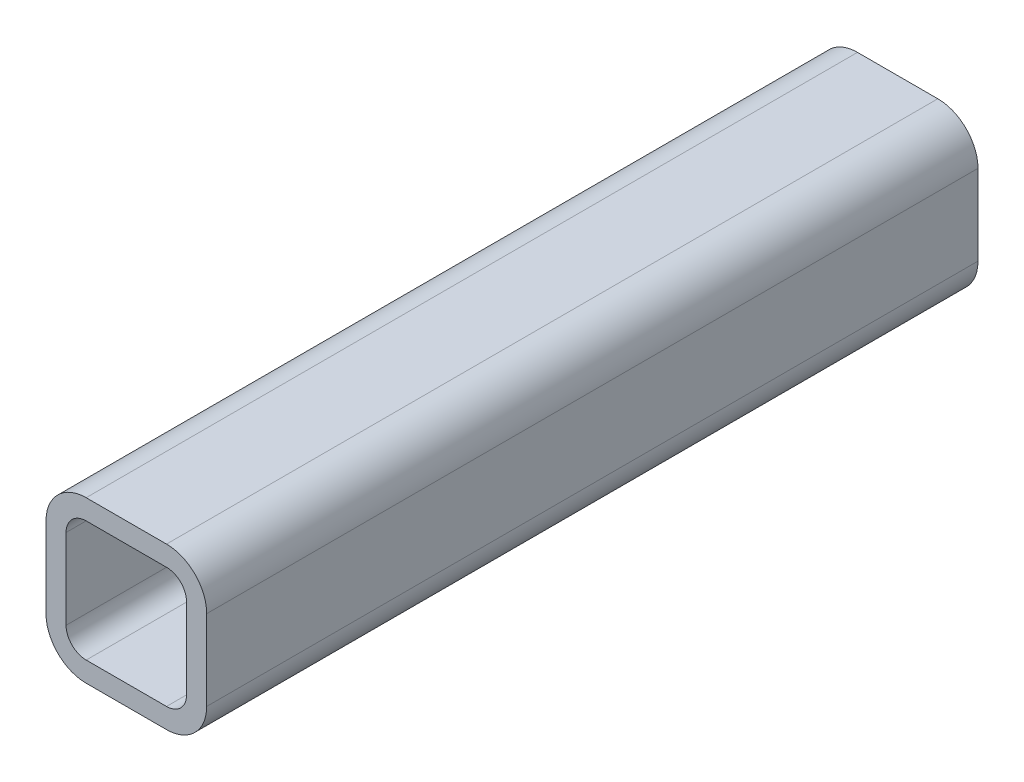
ISO-10303-21;
HEADER;
FILE_DESCRIPTION(('STEP AP214'),'2;1');
FILE_NAME('part.step','',(''),(''),'','','');
FILE_SCHEMA(('AUTOMOTIVE_DESIGN { 1 0 10303 214 1 1 1 1 }'));
ENDSEC;
DATA;
#1=APPLICATION_CONTEXT('core data for automotive mechanical design processes');
#2=APPLICATION_PROTOCOL_DEFINITION('international standard','automotive_design',2000,#1);
#3=PRODUCT_CONTEXT('',#1,'mechanical');
#4=PRODUCT('Part','Part','',(#3));
#5=PRODUCT_RELATED_PRODUCT_CATEGORY('part','',(#4));
#6=PRODUCT_DEFINITION_FORMATION('','',#4);
#7=PRODUCT_DEFINITION_CONTEXT('part definition',#1,'design');
#8=PRODUCT_DEFINITION('design','',#6,#7);
#9=PRODUCT_DEFINITION_SHAPE('','',#8);
#10=(LENGTH_UNIT() NAMED_UNIT(*) SI_UNIT(.MILLI.,.METRE.));
#11=(NAMED_UNIT(*) PLANE_ANGLE_UNIT() SI_UNIT($,.RADIAN.));
#12=(NAMED_UNIT(*) SI_UNIT($,.STERADIAN.) SOLID_ANGLE_UNIT());
#13=UNCERTAINTY_MEASURE_WITH_UNIT(LENGTH_MEASURE(1.E-05),#10,'distance_accuracy_value','');
#14=(GEOMETRIC_REPRESENTATION_CONTEXT(3) GLOBAL_UNCERTAINTY_ASSIGNED_CONTEXT((#13)) GLOBAL_UNIT_ASSIGNED_CONTEXT((#10,
#11,#12)) REPRESENTATION_CONTEXT('',''));
#15=CARTESIAN_POINT('',(0.,0.,0.));
#16=DIRECTION('',(0.,0.,1.));
#17=DIRECTION('',(1.,0.,0.));
#18=AXIS2_PLACEMENT_3D('',#15,#16,#17);
#19=CARTESIAN_POINT('',(18.7710851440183,48.449418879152,304.8));
#20=DIRECTION('',(0.,0.,1.));
#21=DIRECTION('',(1.,0.,0.));
#22=AXIS2_PLACEMENT_3D('',#19,#20,#21);
#23=PLANE('',#22);
#24=CARTESIAN_POINT('',(18.7710851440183,48.449418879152,304.8));
#25=DIRECTION('',(0.,0.,1.));
#26=DIRECTION('',(1.,0.,0.));
#27=AXIS2_PLACEMENT_3D('',#24,#25,#26);
#28=CIRCLE('',#27,15.875);
#29=CARTESIAN_POINT('',(18.7710851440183,64.324418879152,304.8));
#30=VERTEX_POINT('',#29);
#31=CARTESIAN_POINT('',(2.89608514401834,48.449418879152,304.8));
#32=VERTEX_POINT('',#31);
#33=EDGE_CURVE('E211',#30,#32,#28,.T.);
#34=ORIENTED_EDGE('',*,*,#33,.T.);
#35=DIRECTION('',(0.,-1.,0.));
#36=VECTOR('',#35,1.);
#37=CARTESIAN_POINT('',(2.89608514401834,16.699418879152,304.8));
#38=LINE('',#37,#36);
#39=CARTESIAN_POINT('',(2.89608514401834,16.699418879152,304.8));
#40=VERTEX_POINT('',#39);
#41=EDGE_CURVE('E214',#32,#40,#38,.T.);
#42=ORIENTED_EDGE('',*,*,#41,.T.);
#43=CARTESIAN_POINT('',(18.7710851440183,16.699418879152,304.8));
#44=DIRECTION('',(0.,0.,1.));
#45=DIRECTION('',(1.,0.,0.));
#46=AXIS2_PLACEMENT_3D('',#43,#44,#45);
#47=CIRCLE('',#46,15.875);
#48=CARTESIAN_POINT('',(18.7710851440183,0.824418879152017,304.8));
#49=VERTEX_POINT('',#48);
#50=EDGE_CURVE('E217',#40,#49,#47,.T.);
#51=ORIENTED_EDGE('',*,*,#50,.T.);
#52=DIRECTION('',(1.,0.,0.));
#53=VECTOR('',#52,1.);
#54=CARTESIAN_POINT('',(50.5210851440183,0.824418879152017,304.8));
#55=LINE('',#54,#53);
#56=CARTESIAN_POINT('',(50.5210851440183,0.824418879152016,304.8));
#57=VERTEX_POINT('',#56);
#58=EDGE_CURVE('E219',#49,#57,#55,.T.);
#59=ORIENTED_EDGE('',*,*,#58,.T.);
#60=CARTESIAN_POINT('',(50.5210851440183,16.699418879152,304.8));
#61=DIRECTION('',(0.,0.,1.));
#62=DIRECTION('',(1.,0.,0.));
#63=AXIS2_PLACEMENT_3D('',#60,#61,#62);
#64=CIRCLE('',#63,15.875);
#65=CARTESIAN_POINT('',(66.3960851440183,16.699418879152,304.8));
#66=VERTEX_POINT('',#65);
#67=EDGE_CURVE('E221',#57,#66,#64,.T.);
#68=ORIENTED_EDGE('',*,*,#67,.T.);
#69=DIRECTION('',(0.,1.,0.));
#70=VECTOR('',#69,1.);
#71=CARTESIAN_POINT('',(66.3960851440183,48.449418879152,304.8));
#72=LINE('',#71,#70);
#73=CARTESIAN_POINT('',(66.3960851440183,48.449418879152,304.8));
#74=VERTEX_POINT('',#73);
#75=EDGE_CURVE('E223',#66,#74,#72,.T.);
#76=ORIENTED_EDGE('',*,*,#75,.T.);
#77=CARTESIAN_POINT('',(50.5210851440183,48.449418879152,304.8));
#78=DIRECTION('',(0.,0.,1.));
#79=DIRECTION('',(1.,0.,0.));
#80=AXIS2_PLACEMENT_3D('',#77,#78,#79);
#81=CIRCLE('',#80,15.875);
#82=CARTESIAN_POINT('',(50.5210851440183,64.324418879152,304.8));
#83=VERTEX_POINT('',#82);
#84=EDGE_CURVE('E225',#74,#83,#81,.T.);
#85=ORIENTED_EDGE('',*,*,#84,.T.);
#86=DIRECTION('',(-1.,0.,0.));
#87=VECTOR('',#86,1.);
#88=CARTESIAN_POINT('',(18.7710851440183,64.324418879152,304.8));
#89=LINE('',#88,#87);
#90=EDGE_CURVE('E227',#83,#30,#89,.T.);
#91=ORIENTED_EDGE('',*,*,#90,.T.);
#92=EDGE_LOOP('',(#34,#42,#51,#59,#68,#76,#85,#91));
#93=FACE_BOUND('',#92,.T.);
#94=DIRECTION('',(0.,-1.,0.));
#95=VECTOR('',#94,1.);
#96=CARTESIAN_POINT('',(10.8335851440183,16.699418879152,304.8));
#97=LINE('',#96,#95);
#98=CARTESIAN_POINT('',(10.8335851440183,48.449418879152,304.8));
#99=VERTEX_POINT('',#98);
#100=CARTESIAN_POINT('',(10.8335851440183,16.699418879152,304.8));
#101=VERTEX_POINT('',#100);
#102=EDGE_CURVE('E154',#99,#101,#97,.T.);
#103=ORIENTED_EDGE('',*,*,#102,.F.);
#104=CARTESIAN_POINT('',(18.7710851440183,48.449418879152,304.8));
#105=DIRECTION('',(0.,0.,1.));
#106=DIRECTION('',(1.,0.,0.));
#107=AXIS2_PLACEMENT_3D('',#104,#105,#106);
#108=CIRCLE('',#107,7.9375);
#109=CARTESIAN_POINT('',(18.7710851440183,56.386918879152,304.8));
#110=VERTEX_POINT('',#109);
#111=EDGE_CURVE('E146',#110,#99,#108,.T.);
#112=ORIENTED_EDGE('',*,*,#111,.F.);
#113=DIRECTION('',(-1.,0.,0.));
#114=VECTOR('',#113,1.);
#115=CARTESIAN_POINT('',(18.7710851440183,56.386918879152,304.8));
#116=LINE('',#115,#114);
#117=CARTESIAN_POINT('',(50.5210851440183,56.386918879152,304.8));
#118=VERTEX_POINT('',#117);
#119=EDGE_CURVE('E179',#118,#110,#116,.T.);
#120=ORIENTED_EDGE('',*,*,#119,.F.);
#121=CARTESIAN_POINT('',(50.5210851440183,48.449418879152,304.8));
#122=DIRECTION('',(0.,0.,1.));
#123=DIRECTION('',(1.,0.,0.));
#124=AXIS2_PLACEMENT_3D('',#121,#122,#123);
#125=CIRCLE('',#124,7.93750000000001);
#126=CARTESIAN_POINT('',(58.4585851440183,48.449418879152,304.8));
#127=VERTEX_POINT('',#126);
#128=EDGE_CURVE('E177',#127,#118,#125,.T.);
#129=ORIENTED_EDGE('',*,*,#128,.F.);
#130=DIRECTION('',(0.,1.,0.));
#131=VECTOR('',#130,1.);
#132=CARTESIAN_POINT('',(58.4585851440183,48.449418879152,304.8));
#133=LINE('',#132,#131);
#134=CARTESIAN_POINT('',(58.4585851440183,16.699418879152,304.8));
#135=VERTEX_POINT('',#134);
#136=EDGE_CURVE('E175',#135,#127,#133,.T.);
#137=ORIENTED_EDGE('',*,*,#136,.F.);
#138=CARTESIAN_POINT('',(50.5210851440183,16.699418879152,304.8));
#139=DIRECTION('',(0.,0.,1.));
#140=DIRECTION('',(1.,0.,0.));
#141=AXIS2_PLACEMENT_3D('',#138,#139,#140);
#142=CIRCLE('',#141,7.93750000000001);
#143=CARTESIAN_POINT('',(50.5210851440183,8.76191887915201,304.8));
#144=VERTEX_POINT('',#143);
#145=EDGE_CURVE('E173',#144,#135,#142,.T.);
#146=ORIENTED_EDGE('',*,*,#145,.F.);
#147=DIRECTION('',(1.,0.,0.));
#148=VECTOR('',#147,1.);
#149=CARTESIAN_POINT('',(50.5210851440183,8.76191887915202,304.8));
#150=LINE('',#149,#148);
#151=CARTESIAN_POINT('',(18.7710851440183,8.76191887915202,304.8));
#152=VERTEX_POINT('',#151);
#153=EDGE_CURVE('E169',#152,#144,#150,.T.);
#154=ORIENTED_EDGE('',*,*,#153,.F.);
#155=CARTESIAN_POINT('',(18.7710851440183,16.699418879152,304.8));
#156=DIRECTION('',(0.,0.,1.));
#157=DIRECTION('',(1.,0.,0.));
#158=AXIS2_PLACEMENT_3D('',#155,#156,#157);
#159=CIRCLE('',#158,7.9375);
#160=EDGE_CURVE('E167',#101,#152,#159,.T.);
#161=ORIENTED_EDGE('',*,*,#160,.F.);
#162=EDGE_LOOP('',(#103,#112,#120,#129,#137,#146,#154,#161));
#163=FACE_BOUND('',#162,.T.);
#164=ADVANCED_FACE('F33',(#93,#163),#23,.T.);
#165=CARTESIAN_POINT('',(18.7710851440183,48.449418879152,0.));
#166=DIRECTION('',(0.,0.,1.));
#167=DIRECTION('',(1.,0.,0.));
#168=AXIS2_PLACEMENT_3D('',#165,#166,#167);
#169=PLANE('',#168);
#170=CARTESIAN_POINT('',(18.7710851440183,48.449418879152,0.));
#171=DIRECTION('',(0.,0.,1.));
#172=DIRECTION('',(1.,0.,0.));
#173=AXIS2_PLACEMENT_3D('',#170,#171,#172);
#174=CIRCLE('',#173,15.875);
#175=CARTESIAN_POINT('',(18.7710851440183,64.324418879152,0.));
#176=VERTEX_POINT('',#175);
#177=CARTESIAN_POINT('',(2.89608514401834,48.449418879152,0.));
#178=VERTEX_POINT('',#177);
#179=EDGE_CURVE('E162',#176,#178,#174,.T.);
#180=ORIENTED_EDGE('',*,*,#179,.F.);
#181=DIRECTION('',(-1.,0.,0.));
#182=VECTOR('',#181,1.);
#183=CARTESIAN_POINT('',(18.7710851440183,64.324418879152,0.));
#184=LINE('',#183,#182);
#185=CARTESIAN_POINT('',(50.5210851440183,64.324418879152,0.));
#186=VERTEX_POINT('',#185);
#187=EDGE_CURVE('E215',#186,#176,#184,.T.);
#188=ORIENTED_EDGE('',*,*,#187,.F.);
#189=CARTESIAN_POINT('',(50.5210851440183,48.449418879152,0.));
#190=DIRECTION('',(0.,0.,1.));
#191=DIRECTION('',(1.,0.,0.));
#192=AXIS2_PLACEMENT_3D('',#189,#190,#191);
#193=CIRCLE('',#192,15.875);
#194=CARTESIAN_POINT('',(66.3960851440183,48.449418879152,0.));
#195=VERTEX_POINT('',#194);
#196=EDGE_CURVE('E242',#195,#186,#193,.T.);
#197=ORIENTED_EDGE('',*,*,#196,.F.);
#198=DIRECTION('',(0.,1.,0.));
#199=VECTOR('',#198,1.);
#200=CARTESIAN_POINT('',(66.3960851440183,48.449418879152,0.));
#201=LINE('',#200,#199);
#202=CARTESIAN_POINT('',(66.3960851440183,16.699418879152,0.));
#203=VERTEX_POINT('',#202);
#204=EDGE_CURVE('E240',#203,#195,#201,.T.);
#205=ORIENTED_EDGE('',*,*,#204,.F.);
#206=CARTESIAN_POINT('',(50.5210851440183,16.699418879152,0.));
#207=DIRECTION('',(0.,0.,1.));
#208=DIRECTION('',(1.,0.,0.));
#209=AXIS2_PLACEMENT_3D('',#206,#207,#208);
#210=CIRCLE('',#209,15.875);
#211=CARTESIAN_POINT('',(50.5210851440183,0.824418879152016,0.));
#212=VERTEX_POINT('',#211);
#213=EDGE_CURVE('E238',#212,#203,#210,.T.);
#214=ORIENTED_EDGE('',*,*,#213,.F.);
#215=DIRECTION('',(1.,0.,0.));
#216=VECTOR('',#215,1.);
#217=CARTESIAN_POINT('',(50.5210851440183,0.824418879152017,0.));
#218=LINE('',#217,#216);
#219=CARTESIAN_POINT('',(18.7710851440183,0.824418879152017,0.));
#220=VERTEX_POINT('',#219);
#221=EDGE_CURVE('E236',#220,#212,#218,.T.);
#222=ORIENTED_EDGE('',*,*,#221,.F.);
#223=CARTESIAN_POINT('',(18.7710851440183,16.699418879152,0.));
#224=DIRECTION('',(0.,0.,1.));
#225=DIRECTION('',(1.,0.,0.));
#226=AXIS2_PLACEMENT_3D('',#223,#224,#225);
#227=CIRCLE('',#226,15.875);
#228=CARTESIAN_POINT('',(2.89608514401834,16.699418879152,0.));
#229=VERTEX_POINT('',#228);
#230=EDGE_CURVE('E234',#229,#220,#227,.T.);
#231=ORIENTED_EDGE('',*,*,#230,.F.);
#232=DIRECTION('',(0.,-1.,0.));
#233=VECTOR('',#232,1.);
#234=CARTESIAN_POINT('',(2.89608514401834,16.699418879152,0.));
#235=LINE('',#234,#233);
#236=EDGE_CURVE('E232',#178,#229,#235,.T.);
#237=ORIENTED_EDGE('',*,*,#236,.F.);
#238=EDGE_LOOP('',(#180,#188,#197,#205,#214,#222,#231,#237));
#239=FACE_BOUND('',#238,.T.);
#240=CARTESIAN_POINT('',(18.7710851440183,48.449418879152,0.));
#241=DIRECTION('',(0.,0.,1.));
#242=DIRECTION('',(1.,0.,0.));
#243=AXIS2_PLACEMENT_3D('',#240,#241,#242);
#244=CIRCLE('',#243,7.9375);
#245=CARTESIAN_POINT('',(18.7710851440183,56.386918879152,0.));
#246=VERTEX_POINT('',#245);
#247=CARTESIAN_POINT('',(10.8335851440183,48.449418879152,0.));
#248=VERTEX_POINT('',#247);
#249=EDGE_CURVE('E56',#246,#248,#244,.T.);
#250=ORIENTED_EDGE('',*,*,#249,.T.);
#251=DIRECTION('',(0.,-1.,0.));
#252=VECTOR('',#251,1.);
#253=CARTESIAN_POINT('',(10.8335851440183,16.699418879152,0.));
#254=LINE('',#253,#252);
#255=CARTESIAN_POINT('',(10.8335851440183,16.699418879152,0.));
#256=VERTEX_POINT('',#255);
#257=EDGE_CURVE('E161',#248,#256,#254,.T.);
#258=ORIENTED_EDGE('',*,*,#257,.T.);
#259=CARTESIAN_POINT('',(18.7710851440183,16.699418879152,0.));
#260=DIRECTION('',(0.,0.,1.));
#261=DIRECTION('',(1.,0.,0.));
#262=AXIS2_PLACEMENT_3D('',#259,#260,#261);
#263=CIRCLE('',#262,7.9375);
#264=CARTESIAN_POINT('',(18.7710851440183,8.76191887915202,0.));
#265=VERTEX_POINT('',#264);
#266=EDGE_CURVE('E183',#256,#265,#263,.T.);
#267=ORIENTED_EDGE('',*,*,#266,.T.);
#268=DIRECTION('',(1.,0.,0.));
#269=VECTOR('',#268,1.);
#270=CARTESIAN_POINT('',(50.5210851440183,8.76191887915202,0.));
#271=LINE('',#270,#269);
#272=CARTESIAN_POINT('',(50.5210851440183,8.76191887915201,0.));
#273=VERTEX_POINT('',#272);
#274=EDGE_CURVE('E186',#265,#273,#271,.T.);
#275=ORIENTED_EDGE('',*,*,#274,.T.);
#276=CARTESIAN_POINT('',(50.5210851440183,16.699418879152,0.));
#277=DIRECTION('',(0.,0.,1.));
#278=DIRECTION('',(1.,0.,0.));
#279=AXIS2_PLACEMENT_3D('',#276,#277,#278);
#280=CIRCLE('',#279,7.93750000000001);
#281=CARTESIAN_POINT('',(58.4585851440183,16.699418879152,0.));
#282=VERTEX_POINT('',#281);
#283=EDGE_CURVE('E189',#273,#282,#280,.T.);
#284=ORIENTED_EDGE('',*,*,#283,.T.);
#285=DIRECTION('',(0.,1.,0.));
#286=VECTOR('',#285,1.);
#287=CARTESIAN_POINT('',(58.4585851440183,48.449418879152,0.));
#288=LINE('',#287,#286);
#289=CARTESIAN_POINT('',(58.4585851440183,48.449418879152,0.));
#290=VERTEX_POINT('',#289);
#291=EDGE_CURVE('E192',#282,#290,#288,.T.);
#292=ORIENTED_EDGE('',*,*,#291,.T.);
#293=CARTESIAN_POINT('',(50.5210851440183,48.449418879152,0.));
#294=DIRECTION('',(0.,0.,1.));
#295=DIRECTION('',(1.,0.,0.));
#296=AXIS2_PLACEMENT_3D('',#293,#294,#295);
#297=CIRCLE('',#296,7.93750000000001);
#298=CARTESIAN_POINT('',(50.5210851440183,56.386918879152,0.));
#299=VERTEX_POINT('',#298);
#300=EDGE_CURVE('E195',#290,#299,#297,.T.);
#301=ORIENTED_EDGE('',*,*,#300,.T.);
#302=DIRECTION('',(-1.,0.,0.));
#303=VECTOR('',#302,1.);
#304=CARTESIAN_POINT('',(18.7710851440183,56.386918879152,0.));
#305=LINE('',#304,#303);
#306=EDGE_CURVE('E155',#299,#246,#305,.T.);
#307=ORIENTED_EDGE('',*,*,#306,.T.);
#308=EDGE_LOOP('',(#250,#258,#267,#275,#284,#292,#301,#307));
#309=FACE_BOUND('',#308,.T.);
#310=ADVANCED_FACE('F272',(#239,#309),#169,.F.);
#311=CARTESIAN_POINT('',(18.7710851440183,48.449418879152,304.8));
#312=DIRECTION('',(0.,0.,-1.));
#313=DIRECTION('',(-1.,0.,0.));
#314=AXIS2_PLACEMENT_3D('',#311,#312,#313);
#315=CYLINDRICAL_SURFACE('',#314,15.875);
#316=ORIENTED_EDGE('',*,*,#179,.T.);
#317=DIRECTION('',(0.,0.,-1.));
#318=VECTOR('',#317,1.);
#319=CARTESIAN_POINT('',(2.89608514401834,48.449418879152,304.8));
#320=LINE('',#319,#318);
#321=EDGE_CURVE('E11',#32,#178,#320,.T.);
#322=ORIENTED_EDGE('',*,*,#321,.F.);
#323=ORIENTED_EDGE('',*,*,#33,.F.);
#324=DIRECTION('',(0.,0.,-1.));
#325=VECTOR('',#324,1.);
#326=CARTESIAN_POINT('',(18.7710851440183,64.324418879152,304.8));
#327=LINE('',#326,#325);
#328=EDGE_CURVE('E229',#30,#176,#327,.T.);
#329=ORIENTED_EDGE('',*,*,#328,.T.);
#330=EDGE_LOOP('',(#316,#322,#323,#329));
#331=FACE_BOUND('',#330,.T.);
#332=ADVANCED_FACE('F35',(#331),#315,.T.);
#333=CARTESIAN_POINT('',(2.89608514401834,16.699418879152,304.8));
#334=DIRECTION('',(1.,0.,0.));
#335=DIRECTION('',(0.,0.,-1.));
#336=AXIS2_PLACEMENT_3D('',#333,#334,#335);
#337=PLANE('',#336);
#338=ORIENTED_EDGE('',*,*,#236,.T.);
#339=DIRECTION('',(0.,0.,-1.));
#340=VECTOR('',#339,1.);
#341=CARTESIAN_POINT('',(2.89608514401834,16.699418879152,304.8));
#342=LINE('',#341,#340);
#343=EDGE_CURVE('E41',#40,#229,#342,.T.);
#344=ORIENTED_EDGE('',*,*,#343,.F.);
#345=ORIENTED_EDGE('',*,*,#41,.F.);
#346=ORIENTED_EDGE('',*,*,#321,.T.);
#347=EDGE_LOOP('',(#338,#344,#345,#346));
#348=FACE_BOUND('',#347,.T.);
#349=ADVANCED_FACE('F289',(#348),#337,.F.);
#350=CARTESIAN_POINT('',(18.7710851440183,16.699418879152,304.8));
#351=DIRECTION('',(0.,0.,-1.));
#352=DIRECTION('',(-1.,0.,0.));
#353=AXIS2_PLACEMENT_3D('',#350,#351,#352);
#354=CYLINDRICAL_SURFACE('',#353,15.875);
#355=ORIENTED_EDGE('',*,*,#230,.T.);
#356=DIRECTION('',(0.,0.,-1.));
#357=VECTOR('',#356,1.);
#358=CARTESIAN_POINT('',(18.7710851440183,0.824418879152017,304.8));
#359=LINE('',#358,#357);
#360=EDGE_CURVE('E259',#49,#220,#359,.T.);
#361=ORIENTED_EDGE('',*,*,#360,.F.);
#362=ORIENTED_EDGE('',*,*,#50,.F.);
#363=ORIENTED_EDGE('',*,*,#343,.T.);
#364=EDGE_LOOP('',(#355,#361,#362,#363));
#365=FACE_BOUND('',#364,.T.);
#366=ADVANCED_FACE('F266',(#365),#354,.T.);
#367=CARTESIAN_POINT('',(50.5210851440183,0.824418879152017,304.8));
#368=DIRECTION('',(0.,1.,0.));
#369=DIRECTION('',(0.,0.,1.));
#370=AXIS2_PLACEMENT_3D('',#367,#368,#369);
#371=PLANE('',#370);
#372=ORIENTED_EDGE('',*,*,#221,.T.);
#373=DIRECTION('',(0.,0.,-1.));
#374=VECTOR('',#373,1.);
#375=CARTESIAN_POINT('',(50.5210851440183,0.824418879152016,304.8));
#376=LINE('',#375,#374);
#377=EDGE_CURVE('E256',#57,#212,#376,.T.);
#378=ORIENTED_EDGE('',*,*,#377,.F.);
#379=ORIENTED_EDGE('',*,*,#58,.F.);
#380=ORIENTED_EDGE('',*,*,#360,.T.);
#381=EDGE_LOOP('',(#372,#378,#379,#380));
#382=FACE_BOUND('',#381,.T.);
#383=ADVANCED_FACE('F278',(#382),#371,.F.);
#384=CARTESIAN_POINT('',(50.5210851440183,16.699418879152,304.8));
#385=DIRECTION('',(0.,0.,-1.));
#386=DIRECTION('',(-1.,0.,0.));
#387=AXIS2_PLACEMENT_3D('',#384,#385,#386);
#388=CYLINDRICAL_SURFACE('',#387,15.875);
#389=ORIENTED_EDGE('',*,*,#213,.T.);
#390=DIRECTION('',(0.,0.,-1.));
#391=VECTOR('',#390,1.);
#392=CARTESIAN_POINT('',(66.3960851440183,16.699418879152,304.8));
#393=LINE('',#392,#391);
#394=EDGE_CURVE('E253',#66,#203,#393,.T.);
#395=ORIENTED_EDGE('',*,*,#394,.F.);
#396=ORIENTED_EDGE('',*,*,#67,.F.);
#397=ORIENTED_EDGE('',*,*,#377,.T.);
#398=EDGE_LOOP('',(#389,#395,#396,#397));
#399=FACE_BOUND('',#398,.T.);
#400=ADVANCED_FACE('F282',(#399),#388,.T.);
#401=CARTESIAN_POINT('',(66.3960851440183,48.449418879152,304.8));
#402=DIRECTION('',(-1.,0.,0.));
#403=DIRECTION('',(0.,0.,1.));
#404=AXIS2_PLACEMENT_3D('',#401,#402,#403);
#405=PLANE('',#404);
#406=ORIENTED_EDGE('',*,*,#204,.T.);
#407=DIRECTION('',(0.,0.,-1.));
#408=VECTOR('',#407,1.);
#409=CARTESIAN_POINT('',(66.3960851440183,48.449418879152,304.8));
#410=LINE('',#409,#408);
#411=EDGE_CURVE('E250',#74,#195,#410,.T.);
#412=ORIENTED_EDGE('',*,*,#411,.F.);
#413=ORIENTED_EDGE('',*,*,#75,.F.);
#414=ORIENTED_EDGE('',*,*,#394,.T.);
#415=EDGE_LOOP('',(#406,#412,#413,#414));
#416=FACE_BOUND('',#415,.T.);
#417=ADVANCED_FACE('F302',(#416),#405,.F.);
#418=CARTESIAN_POINT('',(50.5210851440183,48.449418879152,304.8));
#419=DIRECTION('',(0.,0.,-1.));
#420=DIRECTION('',(-1.,0.,0.));
#421=AXIS2_PLACEMENT_3D('',#418,#419,#420);
#422=CYLINDRICAL_SURFACE('',#421,15.875);
#423=ORIENTED_EDGE('',*,*,#196,.T.);
#424=DIRECTION('',(0.,0.,-1.));
#425=VECTOR('',#424,1.);
#426=CARTESIAN_POINT('',(50.5210851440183,64.324418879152,304.8));
#427=LINE('',#426,#425);
#428=EDGE_CURVE('E247',#83,#186,#427,.T.);
#429=ORIENTED_EDGE('',*,*,#428,.F.);
#430=ORIENTED_EDGE('',*,*,#84,.F.);
#431=ORIENTED_EDGE('',*,*,#411,.T.);
#432=EDGE_LOOP('',(#423,#429,#430,#431));
#433=FACE_BOUND('',#432,.T.);
#434=ADVANCED_FACE('F300',(#433),#422,.T.);
#435=CARTESIAN_POINT('',(18.7710851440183,64.324418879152,304.8));
#436=DIRECTION('',(0.,-1.,0.));
#437=DIRECTION('',(0.,0.,-1.));
#438=AXIS2_PLACEMENT_3D('',#435,#436,#437);
#439=PLANE('',#438);
#440=ORIENTED_EDGE('',*,*,#187,.T.);
#441=ORIENTED_EDGE('',*,*,#328,.F.);
#442=ORIENTED_EDGE('',*,*,#90,.F.);
#443=ORIENTED_EDGE('',*,*,#428,.T.);
#444=EDGE_LOOP('',(#440,#441,#442,#443));
#445=FACE_BOUND('',#444,.T.);
#446=ADVANCED_FACE('F295',(#445),#439,.F.);
#447=CARTESIAN_POINT('',(18.7710851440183,48.449418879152,304.8));
#448=DIRECTION('',(0.,0.,-1.));
#449=DIRECTION('',(-1.,0.,0.));
#450=AXIS2_PLACEMENT_3D('',#447,#448,#449);
#451=CYLINDRICAL_SURFACE('',#450,7.9375);
#452=ORIENTED_EDGE('',*,*,#249,.F.);
#453=DIRECTION('',(0.,0.,-1.));
#454=VECTOR('',#453,1.);
#455=CARTESIAN_POINT('',(18.7710851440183,56.386918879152,304.8));
#456=LINE('',#455,#454);
#457=EDGE_CURVE('E150',#110,#246,#456,.T.);
#458=ORIENTED_EDGE('',*,*,#457,.F.);
#459=ORIENTED_EDGE('',*,*,#111,.T.);
#460=DIRECTION('',(0.,0.,-1.));
#461=VECTOR('',#460,1.);
#462=CARTESIAN_POINT('',(10.8335851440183,48.449418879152,304.8));
#463=LINE('',#462,#461);
#464=EDGE_CURVE('E149',#99,#248,#463,.T.);
#465=ORIENTED_EDGE('',*,*,#464,.T.);
#466=EDGE_LOOP('',(#452,#458,#459,#465));
#467=FACE_BOUND('',#466,.T.);
#468=ADVANCED_FACE('F148',(#467),#451,.F.);
#469=CARTESIAN_POINT('',(10.8335851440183,16.699418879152,304.8));
#470=DIRECTION('',(1.,0.,0.));
#471=DIRECTION('',(0.,0.,-1.));
#472=AXIS2_PLACEMENT_3D('',#469,#470,#471);
#473=PLANE('',#472);
#474=ORIENTED_EDGE('',*,*,#257,.F.);
#475=ORIENTED_EDGE('',*,*,#464,.F.);
#476=ORIENTED_EDGE('',*,*,#102,.T.);
#477=DIRECTION('',(0.,0.,-1.));
#478=VECTOR('',#477,1.);
#479=CARTESIAN_POINT('',(10.8335851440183,16.699418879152,304.8));
#480=LINE('',#479,#478);
#481=EDGE_CURVE('E163',#101,#256,#480,.T.);
#482=ORIENTED_EDGE('',*,*,#481,.T.);
#483=EDGE_LOOP('',(#474,#475,#476,#482));
#484=FACE_BOUND('',#483,.T.);
#485=ADVANCED_FACE('F158',(#484),#473,.T.);
#486=CARTESIAN_POINT('',(18.7710851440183,16.699418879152,304.8));
#487=DIRECTION('',(0.,0.,-1.));
#488=DIRECTION('',(-1.,0.,0.));
#489=AXIS2_PLACEMENT_3D('',#486,#487,#488);
#490=CYLINDRICAL_SURFACE('',#489,7.9375);
#491=ORIENTED_EDGE('',*,*,#266,.F.);
#492=ORIENTED_EDGE('',*,*,#481,.F.);
#493=ORIENTED_EDGE('',*,*,#160,.T.);
#494=DIRECTION('',(0.,0.,-1.));
#495=VECTOR('',#494,1.);
#496=CARTESIAN_POINT('',(18.7710851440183,8.76191887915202,304.8));
#497=LINE('',#496,#495);
#498=EDGE_CURVE('E208',#152,#265,#497,.T.);
#499=ORIENTED_EDGE('',*,*,#498,.T.);
#500=EDGE_LOOP('',(#491,#492,#493,#499));
#501=FACE_BOUND('',#500,.T.);
#502=ADVANCED_FACE('F327',(#501),#490,.F.);
#503=CARTESIAN_POINT('',(50.5210851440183,8.76191887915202,304.8));
#504=DIRECTION('',(0.,1.,0.));
#505=DIRECTION('',(0.,0.,1.));
#506=AXIS2_PLACEMENT_3D('',#503,#504,#505);
#507=PLANE('',#506);
#508=ORIENTED_EDGE('',*,*,#274,.F.);
#509=ORIENTED_EDGE('',*,*,#498,.F.);
#510=ORIENTED_EDGE('',*,*,#153,.T.);
#511=DIRECTION('',(0.,0.,-1.));
#512=VECTOR('',#511,1.);
#513=CARTESIAN_POINT('',(50.5210851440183,8.76191887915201,304.8));
#514=LINE('',#513,#512);
#515=EDGE_CURVE('E206',#144,#273,#514,.T.);
#516=ORIENTED_EDGE('',*,*,#515,.T.);
#517=EDGE_LOOP('',(#508,#509,#510,#516));
#518=FACE_BOUND('',#517,.T.);
#519=ADVANCED_FACE('F331',(#518),#507,.T.);
#520=CARTESIAN_POINT('',(50.5210851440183,16.699418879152,304.8));
#521=DIRECTION('',(0.,0.,-1.));
#522=DIRECTION('',(-1.,0.,0.));
#523=AXIS2_PLACEMENT_3D('',#520,#521,#522);
#524=CYLINDRICAL_SURFACE('',#523,7.93750000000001);
#525=ORIENTED_EDGE('',*,*,#283,.F.);
#526=ORIENTED_EDGE('',*,*,#515,.F.);
#527=ORIENTED_EDGE('',*,*,#145,.T.);
#528=DIRECTION('',(0.,0.,-1.));
#529=VECTOR('',#528,1.);
#530=CARTESIAN_POINT('',(58.4585851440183,16.699418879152,304.8));
#531=LINE('',#530,#529);
#532=EDGE_CURVE('E204',#135,#282,#531,.T.);
#533=ORIENTED_EDGE('',*,*,#532,.T.);
#534=EDGE_LOOP('',(#525,#526,#527,#533));
#535=FACE_BOUND('',#534,.T.);
#536=ADVANCED_FACE('F337',(#535),#524,.F.);
#537=CARTESIAN_POINT('',(58.4585851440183,48.449418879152,304.8));
#538=DIRECTION('',(-1.,0.,0.));
#539=DIRECTION('',(0.,0.,1.));
#540=AXIS2_PLACEMENT_3D('',#537,#538,#539);
#541=PLANE('',#540);
#542=ORIENTED_EDGE('',*,*,#291,.F.);
#543=ORIENTED_EDGE('',*,*,#532,.F.);
#544=ORIENTED_EDGE('',*,*,#136,.T.);
#545=DIRECTION('',(0.,0.,-1.));
#546=VECTOR('',#545,1.);
#547=CARTESIAN_POINT('',(58.4585851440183,48.449418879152,304.8));
#548=LINE('',#547,#546);
#549=EDGE_CURVE('E202',#127,#290,#548,.T.);
#550=ORIENTED_EDGE('',*,*,#549,.T.);
#551=EDGE_LOOP('',(#542,#543,#544,#550));
#552=FACE_BOUND('',#551,.T.);
#553=ADVANCED_FACE('F341',(#552),#541,.T.);
#554=CARTESIAN_POINT('',(50.5210851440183,48.449418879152,304.8));
#555=DIRECTION('',(0.,0.,-1.));
#556=DIRECTION('',(-1.,0.,0.));
#557=AXIS2_PLACEMENT_3D('',#554,#555,#556);
#558=CYLINDRICAL_SURFACE('',#557,7.93750000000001);
#559=ORIENTED_EDGE('',*,*,#300,.F.);
#560=ORIENTED_EDGE('',*,*,#549,.F.);
#561=ORIENTED_EDGE('',*,*,#128,.T.);
#562=DIRECTION('',(0.,0.,-1.));
#563=VECTOR('',#562,1.);
#564=CARTESIAN_POINT('',(50.5210851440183,56.386918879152,304.8));
#565=LINE('',#564,#563);
#566=EDGE_CURVE('E48',#118,#299,#565,.T.);
#567=ORIENTED_EDGE('',*,*,#566,.T.);
#568=EDGE_LOOP('',(#559,#560,#561,#567));
#569=FACE_BOUND('',#568,.T.);
#570=ADVANCED_FACE('F345',(#569),#558,.F.);
#571=CARTESIAN_POINT('',(18.7710851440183,56.386918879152,304.8));
#572=DIRECTION('',(0.,-1.,0.));
#573=DIRECTION('',(0.,0.,-1.));
#574=AXIS2_PLACEMENT_3D('',#571,#572,#573);
#575=PLANE('',#574);
#576=ORIENTED_EDGE('',*,*,#306,.F.);
#577=ORIENTED_EDGE('',*,*,#566,.F.);
#578=ORIENTED_EDGE('',*,*,#119,.T.);
#579=ORIENTED_EDGE('',*,*,#457,.T.);
#580=EDGE_LOOP('',(#576,#577,#578,#579));
#581=FACE_BOUND('',#580,.T.);
#582=ADVANCED_FACE('F349',(#581),#575,.T.);
#583=CLOSED_SHELL('',(#164,#310,#332,#349,#366,#383,#400,#417,#434,#446,#468,#485,#502,#519,
#536,#553,#570,#582));
#584=MANIFOLD_SOLID_BREP('B2',#583);
#585=ADVANCED_BREP_SHAPE_REPRESENTATION('',(#18,#584),#14);
#586=SHAPE_DEFINITION_REPRESENTATION(#9,#585);
ENDSEC;
END-ISO-10303-21;
